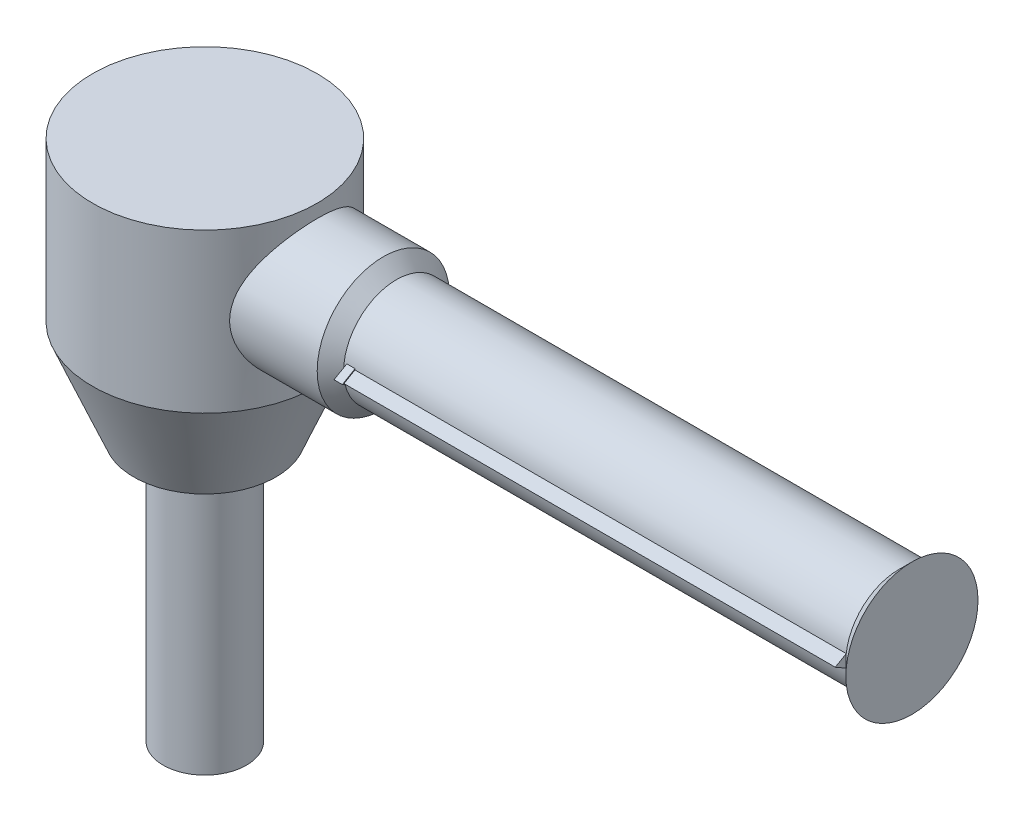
from build123d import *

# Parameters (mm, degrees)
SKETCH3_R           = 14.575269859
SKETCH3_R_2         = 11.984469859
SKETCH3_R_3         = 3.2004
CUT_EXTRUDE1_DEPTH  = 60.96
SKETCH7_R           = 10
SKETCH7_R_2         = 6
BOSS_EXTRUDE3_DEPTH = 63.5
BOSS_EXTRUDE1_DEPTH = 120.015
BOSS_EXTRUDE2_START = -2
BOSS_EXTRUDE2_DEPTH = 2


with BuildPart() as part:
    # Sketch1 → Revolve1 (revolve)
    with BuildSketch(Plane.XY, mode=Mode.PRIVATE) as revolve1_sk:
        Polygon((0, 0), (17.089869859, 0), (26.9875, 23.8125), (26.9875, 61.9125), (0, 61.9125), align=None)
    revolve(revolve1_sk.sketch.rotate(Axis((0, 0, 0), (0, 1, 0)), 90), axis=Axis((0, 0, 0), (0, 1, 0)))

    # Sketch2 → Revolve2 (revolve)
    with BuildSketch(Plane.XY, mode=Mode.PRIVATE) as revolve2_sk:
        Polygon((0, 58.7375), (42.8625, 58.7375), (46.0375, 55.5625), (166.6875, 55.5625), (169.8625, 58.7375), (169.8625, 42.8625), (0, 42.8625), align=None)
    revolve(revolve2_sk.sketch.rotate(Axis((0, 42.8625, 0), (1, 0, 0)), 90), axis=Axis((0, 42.8625, 0), (1, 0, 0)))

    # Sketch3 → Cut-Extrude1 (cut)
    # profile 1 of 2: a face of its own
    with BuildSketch(Plane.XZ):
        with Locations(Location((0, 0, 0), (0, 0, 270))):
            Circle(SKETCH3_R)
        with Locations(Location((0, 0, 0), (0, 0, 270))):
            Circle(SKETCH3_R_2, mode=Mode.SUBTRACT)
    # profile 2 of 2: a face of its own
    with BuildSketch(Plane.XZ):
        with Locations(Location((0, 0, 0), (0, 0, 270))):
            Circle(SKETCH3_R_3)
    extrude(amount=-CUT_EXTRUDE1_DEPTH, mode=Mode.SUBTRACT)

    # Sketch7 → Boss-Extrude3 (add)
    with BuildSketch(Plane.XZ):
        with Locations(Location((0, 0, 0), (0, 0, 270))):
            Circle(SKETCH7_R)
        with Locations(Location((0, 0, 0), (0, 0, 270))):
            Circle(SKETCH7_R_2, mode=Mode.SUBTRACT)
    extrude(amount=BOSS_EXTRUDE3_DEPTH)

    # Sketch5 → Boss-Extrude1 (add)
    with BuildSketch(Plane(origin=(166.6875, 0, 0), x_dir=(0, 0, -1), z_dir=(1, 0, 0))):
        Polygon((-12.608818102, 44.381613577), (-12.608818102, 41.343386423), (-15.24, 42.8625), align=None)
        Polygon((15.155049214, 42.8625), (12.615049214, 44.328969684), (12.615049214, 41.396030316), align=None)
    extrude(amount=-BOSS_EXTRUDE1_DEPTH)

    # Sketch6 → Boss-Extrude2 (add)
    # profile 1 of 2: a face of its own
    with BuildSketch(Plane.ZY.offset(-46.6725).offset(BOSS_EXTRUDE2_START)):
        with BuildLine():
            Line((12.355306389, 40.966081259), (15.64, 42.8625))
            Line((15.64, 42.8625), (12.355306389, 44.758918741))
            ThreePointArc((12.355306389, 44.758918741), (12.5, 42.8625), (12.355306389, 40.966081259))
        make_face()
        with BuildLine():
            Line((12.608818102, 41.343386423), (15.24, 42.8625))
            Line((15.24, 42.8625), (12.608818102, 44.381613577))
            ThreePointArc((12.608818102, 44.381613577), (12.7, 42.8625), (12.608818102, 41.343386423))
        make_face(mode=Mode.SUBTRACT)
    # profile 2 of 2: a face of its own
    with BuildSketch(Plane.ZY.offset(-46.6725).offset(BOSS_EXTRUDE2_START)):
        with BuildLine():
            Line((-15.555049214, 42.8625), (-12.36343535, 41.019820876))
            ThreePointArc((-12.36343535, 41.019820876), (-12.5, 42.8625), (-12.36343535, 44.705179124))
            Line((-12.36343535, 44.705179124), (-15.555049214, 42.8625))
        make_face()
        with BuildLine():
            Line((-15.155049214, 42.8625), (-12.615049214, 41.396030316))
            ThreePointArc((-12.615049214, 41.396030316), (-12.7, 42.8625), (-12.615049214, 44.328969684))
            Line((-12.615049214, 44.328969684), (-15.155049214, 42.8625))
        make_face(mode=Mode.SUBTRACT)
    extrude(amount=BOSS_EXTRUDE2_DEPTH)


solid = part.part
